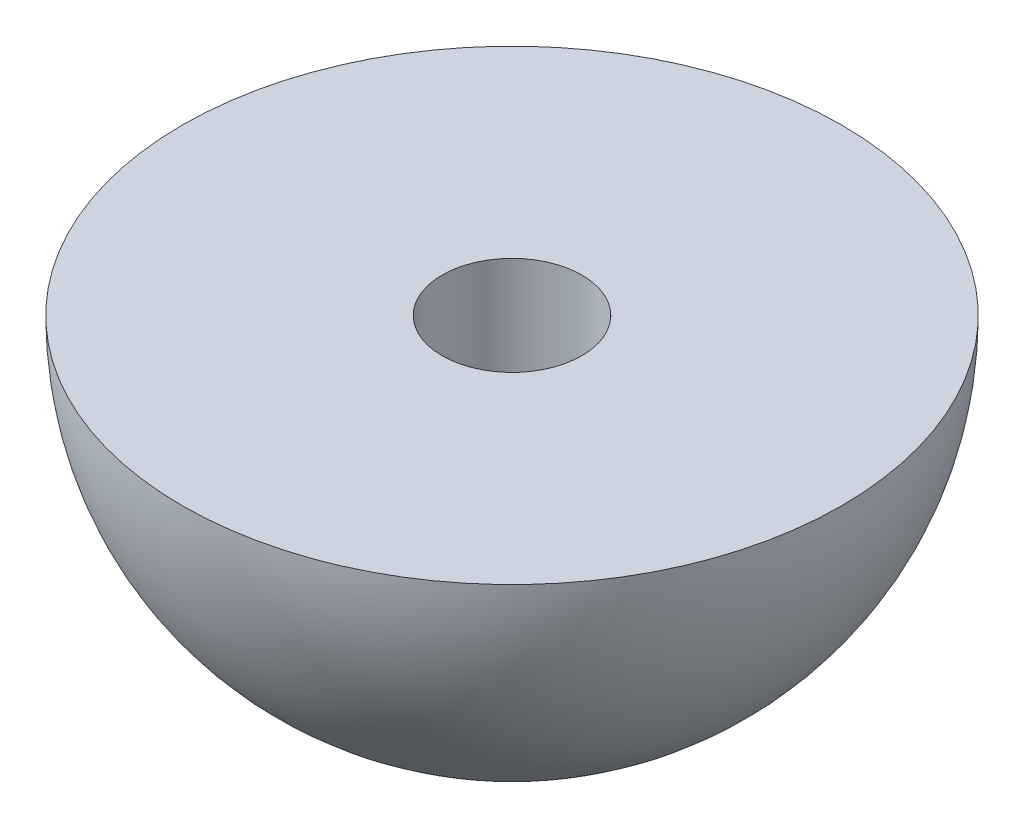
from build123d import *

# Parameters (mm, degrees)
F_10_32_TAPPED_HOLE1_D     = 4.0386
F_10_32_TAPPED_HOLE1_DEPTH = 6.604
F_10_32_TAPPED_HOLE1_TIP   = 1.213317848


with BuildPart() as part:
    # Sketch1 → Revolve1 (revolve)
    with BuildSketch(Plane.XY):
        with BuildLine():
            Line((0, 0), (0, -9.525))
            ThreePointArc((0, -9.525), (-6.735192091, -6.735192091), (-9.525, 0))
            Line((-9.525, 0), (0, 0))
        make_face()
    revolve(axis=Axis((0, 0, 0), (0, -1, 0)))

    # 10-32 Tapped Hole1
    with Locations(Plane(origin=(0, 0, 0), x_dir=(1, 0, 0), z_dir=(0, 1, 0))):
        with Locations((0, 0)):
            Hole(F_10_32_TAPPED_HOLE1_D / 2, depth=F_10_32_TAPPED_HOLE1_DEPTH)
            with Locations((0, 0, -(F_10_32_TAPPED_HOLE1_DEPTH + F_10_32_TAPPED_HOLE1_TIP / 2))):  # 118° drill point
                Cone(0, F_10_32_TAPPED_HOLE1_D / 2, F_10_32_TAPPED_HOLE1_TIP, mode=Mode.SUBTRACT)


solid = part.part
